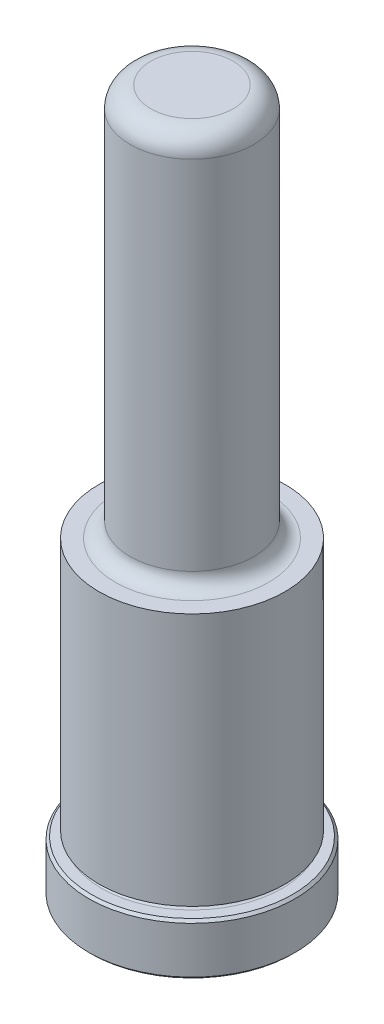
ISO-10303-21;
HEADER;
FILE_DESCRIPTION(('STEP AP214'),'2;1');
FILE_NAME('part.step','',(''),(''),'','','');
FILE_SCHEMA(('AUTOMOTIVE_DESIGN { 1 0 10303 214 1 1 1 1 }'));
ENDSEC;
DATA;
#1=APPLICATION_CONTEXT('core data for automotive mechanical design processes');
#2=APPLICATION_PROTOCOL_DEFINITION('international standard','automotive_design',2000,#1);
#3=PRODUCT_CONTEXT('',#1,'mechanical');
#4=PRODUCT('Part','Part','',(#3));
#5=PRODUCT_RELATED_PRODUCT_CATEGORY('part','',(#4));
#6=PRODUCT_DEFINITION_FORMATION('','',#4);
#7=PRODUCT_DEFINITION_CONTEXT('part definition',#1,'design');
#8=PRODUCT_DEFINITION('design','',#6,#7);
#9=PRODUCT_DEFINITION_SHAPE('','',#8);
#10=(LENGTH_UNIT() NAMED_UNIT(*) SI_UNIT(.MILLI.,.METRE.));
#11=(NAMED_UNIT(*) PLANE_ANGLE_UNIT() SI_UNIT($,.RADIAN.));
#12=(NAMED_UNIT(*) SI_UNIT($,.STERADIAN.) SOLID_ANGLE_UNIT());
#13=UNCERTAINTY_MEASURE_WITH_UNIT(LENGTH_MEASURE(1.E-05),#10,'distance_accuracy_value','');
#14=(GEOMETRIC_REPRESENTATION_CONTEXT(3) GLOBAL_UNCERTAINTY_ASSIGNED_CONTEXT((#13)) GLOBAL_UNIT_ASSIGNED_CONTEXT((#10,
#11,#12)) REPRESENTATION_CONTEXT('',''));
#15=CARTESIAN_POINT('',(0.,0.,0.));
#16=DIRECTION('',(0.,0.,1.));
#17=DIRECTION('',(1.,0.,0.));
#18=AXIS2_PLACEMENT_3D('',#15,#16,#17);
#19=CARTESIAN_POINT('',(0.,0.,0.));
#20=DIRECTION('',(0.,1.,0.));
#21=DIRECTION('',(0.,0.,1.));
#22=AXIS2_PLACEMENT_3D('',#19,#20,#21);
#23=PLANE('',#22);
#24=CARTESIAN_POINT('',(0.,0.,0.));
#25=DIRECTION('',(0.,1.,0.));
#26=DIRECTION('',(0.,0.,1.));
#27=AXIS2_PLACEMENT_3D('',#24,#25,#26);
#28=CIRCLE('',#27,15.494);
#29=CARTESIAN_POINT('',(0.,0.,15.494));
#30=VERTEX_POINT('',#29);
#31=EDGE_CURVE('E46',#30,#30,#28,.F.);
#32=ORIENTED_EDGE('',*,*,#31,.T.);
#33=EDGE_LOOP('',(#32));
#34=FACE_BOUND('',#33,.T.);
#35=ADVANCED_FACE('F31',(#34),#23,.F.);
#36=CARTESIAN_POINT('',(0.,0.,0.));
#37=DIRECTION('',(0.,1.,0.));
#38=DIRECTION('',(0.,0.,1.));
#39=AXIS2_PLACEMENT_3D('',#36,#37,#38);
#40=CYLINDRICAL_SURFACE('',#39,15.875);
#41=CARTESIAN_POINT('',(0.,0.381000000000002,0.));
#42=DIRECTION('',(0.,1.,0.));
#43=DIRECTION('',(0.,0.,1.));
#44=AXIS2_PLACEMENT_3D('',#41,#42,#43);
#45=CIRCLE('',#44,15.875);
#46=CARTESIAN_POINT('',(0.,0.381,15.875));
#47=VERTEX_POINT('',#46);
#48=EDGE_CURVE('E51',#47,#47,#45,.T.);
#49=ORIENTED_EDGE('',*,*,#48,.T.);
#50=EDGE_LOOP('',(#49));
#51=FACE_BOUND('',#50,.T.);
#52=CARTESIAN_POINT('',(0.,7.54380000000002,0.));
#53=DIRECTION('',(0.,-1.,0.));
#54=DIRECTION('',(0.,0.,-1.));
#55=AXIS2_PLACEMENT_3D('',#52,#53,#54);
#56=CIRCLE('',#55,15.875);
#57=CARTESIAN_POINT('',(0.,7.54380000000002,-15.875));
#58=VERTEX_POINT('',#57);
#59=EDGE_CURVE('E54',#58,#58,#56,.T.);
#60=ORIENTED_EDGE('',*,*,#59,.T.);
#61=EDGE_LOOP('',(#60));
#62=FACE_BOUND('',#61,.T.);
#63=ADVANCED_FACE('F110',(#51,#62),#40,.T.);
#64=CARTESIAN_POINT('',(0.,7.9248,-15.875));
#65=DIRECTION('',(0.,-1.,0.));
#66=DIRECTION('',(0.,0.,-1.));
#67=AXIS2_PLACEMENT_3D('',#64,#65,#66);
#68=PLANE('',#67);
#69=CARTESIAN_POINT('',(0.,7.9248,0.));
#70=DIRECTION('',(0.,-1.,0.));
#71=DIRECTION('',(0.,0.,-1.));
#72=AXIS2_PLACEMENT_3D('',#69,#70,#71);
#73=CIRCLE('',#72,15.494);
#74=CARTESIAN_POINT('',(0.,7.9248,-15.494));
#75=VERTEX_POINT('',#74);
#76=EDGE_CURVE('E42',#75,#75,#73,.F.);
#77=ORIENTED_EDGE('',*,*,#76,.T.);
#78=EDGE_LOOP('',(#77));
#79=FACE_BOUND('',#78,.T.);
#80=CARTESIAN_POINT('',(0.,7.9248,0.));
#81=DIRECTION('',(0.,1.,0.));
#82=DIRECTION('',(0.,0.,1.));
#83=AXIS2_PLACEMENT_3D('',#80,#81,#82);
#84=CIRCLE('',#83,13.8938);
#85=CARTESIAN_POINT('',(0.,7.9248,13.8938));
#86=VERTEX_POINT('',#85);
#87=EDGE_CURVE('E57',#86,#86,#84,.T.);
#88=ORIENTED_EDGE('',*,*,#87,.F.);
#89=EDGE_LOOP('',(#88));
#90=FACE_BOUND('',#89,.T.);
#91=ADVANCED_FACE('F105',(#79,#90),#68,.F.);
#92=CARTESIAN_POINT('',(0.,8.3058,0.));
#93=DIRECTION('',(0.,1.,0.));
#94=DIRECTION('',(0.,0.,1.));
#95=AXIS2_PLACEMENT_3D('',#92,#93,#94);
#96=TOROIDAL_SURFACE('',#95,13.8938,0.381000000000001);
#97=CARTESIAN_POINT('',(0.,8.68680000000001,0.));
#98=DIRECTION('',(0.,1.,0.));
#99=DIRECTION('',(0.,0.,1.));
#100=AXIS2_PLACEMENT_3D('',#97,#98,#99);
#101=CIRCLE('',#100,13.8938);
#102=CARTESIAN_POINT('',(0.,8.6868,13.8938));
#103=VERTEX_POINT('',#102);
#104=EDGE_CURVE('E60',#103,#103,#101,.T.);
#105=ORIENTED_EDGE('',*,*,#104,.F.);
#106=EDGE_LOOP('',(#105));
#107=FACE_BOUND('',#106,.T.);
#108=ORIENTED_EDGE('',*,*,#87,.T.);
#109=EDGE_LOOP('',(#108));
#110=FACE_BOUND('',#109,.T.);
#111=ADVANCED_FACE('F99',(#107,#110),#96,.F.);
#112=CARTESIAN_POINT('',(0.,8.68680000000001,-13.8938));
#113=DIRECTION('',(0.,1.,0.));
#114=DIRECTION('',(0.,0.,1.));
#115=AXIS2_PLACEMENT_3D('',#112,#113,#114);
#116=PLANE('',#115);
#117=CARTESIAN_POINT('',(0.,8.6868,0.));
#118=DIRECTION('',(0.,1.,0.));
#119=DIRECTION('',(0.,0.,1.));
#120=AXIS2_PLACEMENT_3D('',#117,#118,#119);
#121=CIRCLE('',#120,14.3002);
#122=CARTESIAN_POINT('',(0.,8.6868,14.3002));
#123=VERTEX_POINT('',#122);
#124=EDGE_CURVE('E63',#123,#123,#121,.T.);
#125=ORIENTED_EDGE('',*,*,#124,.F.);
#126=EDGE_LOOP('',(#125));
#127=FACE_BOUND('',#126,.T.);
#128=ORIENTED_EDGE('',*,*,#104,.T.);
#129=EDGE_LOOP('',(#128));
#130=FACE_BOUND('',#129,.T.);
#131=ADVANCED_FACE('F93',(#127,#130),#116,.F.);
#132=CARTESIAN_POINT('',(0.,0.,0.));
#133=DIRECTION('',(0.,1.,0.));
#134=DIRECTION('',(0.,0.,1.));
#135=AXIS2_PLACEMENT_3D('',#132,#133,#134);
#136=CYLINDRICAL_SURFACE('',#135,14.3002);
#137=CARTESIAN_POINT('',(0.,47.625,0.));
#138=DIRECTION('',(0.,1.,0.));
#139=DIRECTION('',(0.,0.,1.));
#140=AXIS2_PLACEMENT_3D('',#137,#138,#139);
#141=CIRCLE('',#140,14.3002);
#142=CARTESIAN_POINT('',(0.,47.625,14.3002));
#143=VERTEX_POINT('',#142);
#144=EDGE_CURVE('E66',#143,#143,#141,.T.);
#145=ORIENTED_EDGE('',*,*,#144,.F.);
#146=EDGE_LOOP('',(#145));
#147=FACE_BOUND('',#146,.T.);
#148=ORIENTED_EDGE('',*,*,#124,.T.);
#149=EDGE_LOOP('',(#148));
#150=FACE_BOUND('',#149,.T.);
#151=ADVANCED_FACE('F87',(#147,#150),#136,.T.);
#152=CARTESIAN_POINT('',(0.,47.625,-14.3002));
#153=DIRECTION('',(0.,-1.,0.));
#154=DIRECTION('',(0.,0.,-1.));
#155=AXIS2_PLACEMENT_3D('',#152,#153,#154);
#156=PLANE('',#155);
#157=CARTESIAN_POINT('',(0.,47.625,0.));
#158=DIRECTION('',(0.,1.,0.));
#159=DIRECTION('',(0.,0.,1.));
#160=AXIS2_PLACEMENT_3D('',#157,#158,#159);
#161=CIRCLE('',#160,11.7983);
#162=CARTESIAN_POINT('',(0.,47.625,11.7983));
#163=VERTEX_POINT('',#162);
#164=EDGE_CURVE('E69',#163,#163,#161,.T.);
#165=ORIENTED_EDGE('',*,*,#164,.F.);
#166=EDGE_LOOP('',(#165));
#167=FACE_BOUND('',#166,.T.);
#168=ORIENTED_EDGE('',*,*,#144,.T.);
#169=EDGE_LOOP('',(#168));
#170=FACE_BOUND('',#169,.T.);
#171=ADVANCED_FACE('F81',(#167,#170),#156,.F.);
#172=CARTESIAN_POINT('',(0.,49.911,0.));
#173=DIRECTION('',(0.,1.,0.));
#174=DIRECTION('',(0.,0.,1.));
#175=AXIS2_PLACEMENT_3D('',#172,#173,#174);
#176=TOROIDAL_SURFACE('',#175,11.7983,2.286);
#177=CARTESIAN_POINT('',(0.,49.911,0.));
#178=DIRECTION('',(0.,1.,0.));
#179=DIRECTION('',(0.,0.,1.));
#180=AXIS2_PLACEMENT_3D('',#177,#178,#179);
#181=CIRCLE('',#180,9.5123);
#182=CARTESIAN_POINT('',(0.,49.911,9.5123));
#183=VERTEX_POINT('',#182);
#184=EDGE_CURVE('E72',#183,#183,#181,.T.);
#185=ORIENTED_EDGE('',*,*,#184,.F.);
#186=EDGE_LOOP('',(#185));
#187=FACE_BOUND('',#186,.T.);
#188=ORIENTED_EDGE('',*,*,#164,.T.);
#189=EDGE_LOOP('',(#188));
#190=FACE_BOUND('',#189,.T.);
#191=ADVANCED_FACE('F78',(#187,#190),#176,.F.);
#192=CARTESIAN_POINT('',(0.,0.,0.));
#193=DIRECTION('',(0.,1.,0.));
#194=DIRECTION('',(0.,0.,1.));
#195=AXIS2_PLACEMENT_3D('',#192,#193,#194);
#196=CYLINDRICAL_SURFACE('',#195,9.5123);
#197=CARTESIAN_POINT('',(0.,104.775,0.));
#198=DIRECTION('',(0.,-1.,0.));
#199=DIRECTION('',(0.,0.,-1.));
#200=AXIS2_PLACEMENT_3D('',#197,#198,#199);
#201=CIRCLE('',#200,9.5123);
#202=CARTESIAN_POINT('',(0.,104.775,-9.51229999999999));
#203=VERTEX_POINT('',#202);
#204=EDGE_CURVE('E10',#203,#203,#201,.T.);
#205=ORIENTED_EDGE('',*,*,#204,.T.);
#206=EDGE_LOOP('',(#205));
#207=FACE_BOUND('',#206,.T.);
#208=ORIENTED_EDGE('',*,*,#184,.T.);
#209=EDGE_LOOP('',(#208));
#210=FACE_BOUND('',#209,.T.);
#211=ADVANCED_FACE('F76',(#207,#210),#196,.T.);
#212=CARTESIAN_POINT('',(0.,107.95,-9.51229999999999));
#213=DIRECTION('',(0.,-1.,0.));
#214=DIRECTION('',(0.,0.,-1.));
#215=AXIS2_PLACEMENT_3D('',#212,#213,#214);
#216=PLANE('',#215);
#217=CARTESIAN_POINT('',(0.,107.95,0.));
#218=DIRECTION('',(0.,-1.,0.));
#219=DIRECTION('',(0.,0.,-1.));
#220=AXIS2_PLACEMENT_3D('',#217,#218,#219);
#221=CIRCLE('',#220,6.3373);
#222=CARTESIAN_POINT('',(0.,107.95,-6.33729999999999));
#223=VERTEX_POINT('',#222);
#224=EDGE_CURVE('E38',#223,#223,#221,.F.);
#225=ORIENTED_EDGE('',*,*,#224,.T.);
#226=EDGE_LOOP('',(#225));
#227=FACE_BOUND('',#226,.T.);
#228=ADVANCED_FACE('F127',(#227),#216,.F.);
#229=CARTESIAN_POINT('',(0.,0.381000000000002,0.));
#230=DIRECTION('',(0.,1.,0.));
#231=DIRECTION('',(0.,0.,1.));
#232=AXIS2_PLACEMENT_3D('',#229,#230,#231);
#233=CONICAL_SURFACE('',#232,15.875,0.78539816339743);
#234=ORIENTED_EDGE('',*,*,#31,.F.);
#235=EDGE_LOOP('',(#234));
#236=FACE_BOUND('',#235,.T.);
#237=ORIENTED_EDGE('',*,*,#48,.F.);
#238=EDGE_LOOP('',(#237));
#239=FACE_BOUND('',#238,.T.);
#240=ADVANCED_FACE('F124',(#236,#239),#233,.T.);
#241=CARTESIAN_POINT('',(0.,7.9248,0.));
#242=DIRECTION('',(0.,-1.,0.));
#243=DIRECTION('',(0.,0.,-1.));
#244=AXIS2_PLACEMENT_3D('',#241,#242,#243);
#245=CONICAL_SURFACE('',#244,15.494,0.785398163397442);
#246=ORIENTED_EDGE('',*,*,#59,.F.);
#247=EDGE_LOOP('',(#246));
#248=FACE_BOUND('',#247,.T.);
#249=ORIENTED_EDGE('',*,*,#76,.F.);
#250=EDGE_LOOP('',(#249));
#251=FACE_BOUND('',#250,.T.);
#252=ADVANCED_FACE('F126',(#248,#251),#245,.T.);
#253=CARTESIAN_POINT('',(0.,104.775,0.));
#254=DIRECTION('',(0.,-1.,0.));
#255=DIRECTION('',(0.,0.,-1.));
#256=AXIS2_PLACEMENT_3D('',#253,#254,#255);
#257=TOROIDAL_SURFACE('',#256,6.3373,3.175);
#258=ORIENTED_EDGE('',*,*,#204,.F.);
#259=EDGE_LOOP('',(#258));
#260=FACE_BOUND('',#259,.T.);
#261=ORIENTED_EDGE('',*,*,#224,.F.);
#262=EDGE_LOOP('',(#261));
#263=FACE_BOUND('',#262,.T.);
#264=ADVANCED_FACE('F33',(#260,#263),#257,.T.);
#265=CLOSED_SHELL('',(#35,#63,#91,#111,#131,#151,#171,#191,#211,#228,#240,#252,#264));
#266=MANIFOLD_SOLID_BREP('B2',#265);
#267=ADVANCED_BREP_SHAPE_REPRESENTATION('',(#18,#266),#14);
#268=SHAPE_DEFINITION_REPRESENTATION(#9,#267);
ENDSEC;
END-ISO-10303-21;
